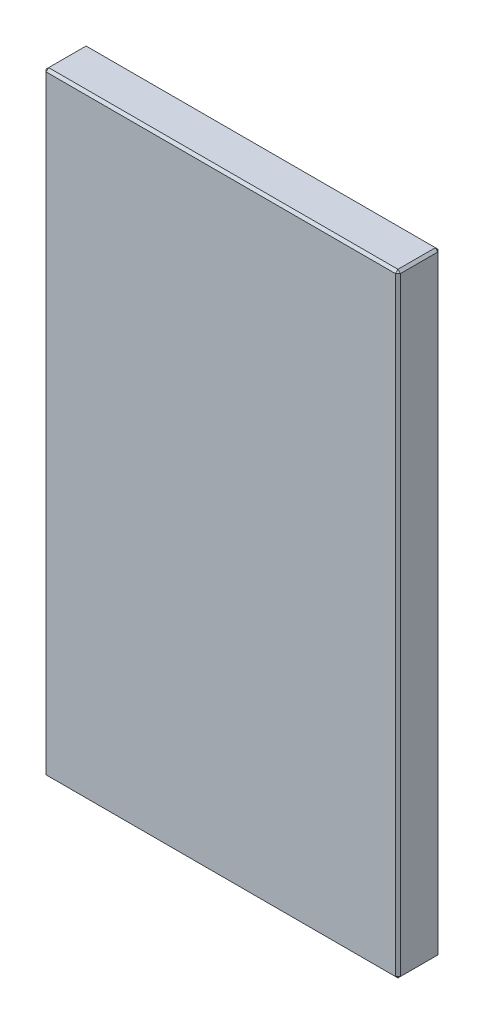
ISO-10303-21;
HEADER;
FILE_DESCRIPTION(('STEP AP214'),'2;1');
FILE_NAME('part.step','',(''),(''),'','','');
FILE_SCHEMA(('AUTOMOTIVE_DESIGN { 1 0 10303 214 1 1 1 1 }'));
ENDSEC;
DATA;
#1=APPLICATION_CONTEXT('core data for automotive mechanical design processes');
#2=APPLICATION_PROTOCOL_DEFINITION('international standard','automotive_design',2000,#1);
#3=PRODUCT_CONTEXT('',#1,'mechanical');
#4=PRODUCT('Part','Part','',(#3));
#5=PRODUCT_RELATED_PRODUCT_CATEGORY('part','',(#4));
#6=PRODUCT_DEFINITION_FORMATION('','',#4);
#7=PRODUCT_DEFINITION_CONTEXT('part definition',#1,'design');
#8=PRODUCT_DEFINITION('design','',#6,#7);
#9=PRODUCT_DEFINITION_SHAPE('','',#8);
#10=(LENGTH_UNIT() NAMED_UNIT(*) SI_UNIT(.MILLI.,.METRE.));
#11=(NAMED_UNIT(*) PLANE_ANGLE_UNIT() SI_UNIT($,.RADIAN.));
#12=(NAMED_UNIT(*) SI_UNIT($,.STERADIAN.) SOLID_ANGLE_UNIT());
#13=UNCERTAINTY_MEASURE_WITH_UNIT(LENGTH_MEASURE(1.E-05),#10,'distance_accuracy_value','');
#14=(GEOMETRIC_REPRESENTATION_CONTEXT(3) GLOBAL_UNCERTAINTY_ASSIGNED_CONTEXT((#13)) GLOBAL_UNIT_ASSIGNED_CONTEXT((#10,
#11,#12)) REPRESENTATION_CONTEXT('',''));
#15=CARTESIAN_POINT('',(0.,0.,0.));
#16=DIRECTION('',(0.,0.,1.));
#17=DIRECTION('',(1.,0.,0.));
#18=AXIS2_PLACEMENT_3D('',#15,#16,#17);
#19=CARTESIAN_POINT('',(-71.,-123.,17.));
#20=DIRECTION('',(1.,0.,0.));
#21=DIRECTION('',(0.,0.,-1.));
#22=AXIS2_PLACEMENT_3D('',#19,#20,#21);
#23=PLANE('',#22);
#24=DIRECTION('',(0.,0.,-1.));
#25=VECTOR('',#24,1.);
#26=CARTESIAN_POINT('',(-71.,122.,17.));
#27=LINE('',#26,#25);
#28=CARTESIAN_POINT('',(-71.,122.,16.));
#29=VERTEX_POINT('',#28);
#30=CARTESIAN_POINT('',(-71.,122.,1.00000000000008));
#31=VERTEX_POINT('',#30);
#32=EDGE_CURVE('E114',#29,#31,#27,.T.);
#33=ORIENTED_EDGE('',*,*,#32,.T.);
#34=DIRECTION('',(0.,-1.,0.));
#35=VECTOR('',#34,1.);
#36=CARTESIAN_POINT('',(-71.,-123.,1.00000000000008));
#37=LINE('',#36,#35);
#38=CARTESIAN_POINT('',(-71.,-122.,1.00000000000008));
#39=VERTEX_POINT('',#38);
#40=EDGE_CURVE('E110',#31,#39,#37,.T.);
#41=ORIENTED_EDGE('',*,*,#40,.T.);
#42=DIRECTION('',(0.,0.,1.));
#43=VECTOR('',#42,1.);
#44=CARTESIAN_POINT('',(-71.,-122.,17.));
#45=LINE('',#44,#43);
#46=CARTESIAN_POINT('',(-71.,-122.,16.));
#47=VERTEX_POINT('',#46);
#48=EDGE_CURVE('E103',#39,#47,#45,.T.);
#49=ORIENTED_EDGE('',*,*,#48,.T.);
#50=DIRECTION('',(0.,1.,0.));
#51=VECTOR('',#50,1.);
#52=CARTESIAN_POINT('',(-71.,123.,16.));
#53=LINE('',#52,#51);
#54=EDGE_CURVE('E107',#47,#29,#53,.T.);
#55=ORIENTED_EDGE('',*,*,#54,.T.);
#56=EDGE_LOOP('',(#33,#41,#49,#55));
#57=FACE_BOUND('',#56,.T.);
#58=ADVANCED_FACE('F15',(#57),#23,.F.);
#59=CARTESIAN_POINT('',(71.,-123.,17.));
#60=DIRECTION('',(0.,1.,0.));
#61=DIRECTION('',(0.,0.,1.));
#62=AXIS2_PLACEMENT_3D('',#59,#60,#61);
#63=PLANE('',#62);
#64=DIRECTION('',(0.,0.,-1.));
#65=VECTOR('',#64,1.);
#66=CARTESIAN_POINT('',(-70.,-123.,17.));
#67=LINE('',#66,#65);
#68=CARTESIAN_POINT('',(-70.,-123.,16.));
#69=VERTEX_POINT('',#68);
#70=CARTESIAN_POINT('',(-70.,-123.,1.00000000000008));
#71=VERTEX_POINT('',#70);
#72=EDGE_CURVE('E122',#69,#71,#67,.T.);
#73=ORIENTED_EDGE('',*,*,#72,.T.);
#74=DIRECTION('',(1.,0.,0.));
#75=VECTOR('',#74,1.);
#76=CARTESIAN_POINT('',(71.,-123.,1.00000000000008));
#77=LINE('',#76,#75);
#78=CARTESIAN_POINT('',(70.,-123.,1.00000000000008));
#79=VERTEX_POINT('',#78);
#80=EDGE_CURVE('E160',#71,#79,#77,.T.);
#81=ORIENTED_EDGE('',*,*,#80,.T.);
#82=DIRECTION('',(0.,0.,1.));
#83=VECTOR('',#82,1.);
#84=CARTESIAN_POINT('',(70.,-123.,17.));
#85=LINE('',#84,#83);
#86=CARTESIAN_POINT('',(70.,-123.,16.));
#87=VERTEX_POINT('',#86);
#88=EDGE_CURVE('E157',#79,#87,#85,.T.);
#89=ORIENTED_EDGE('',*,*,#88,.T.);
#90=DIRECTION('',(-1.,0.,0.));
#91=VECTOR('',#90,1.);
#92=CARTESIAN_POINT('',(-71.,-123.,16.));
#93=LINE('',#92,#91);
#94=EDGE_CURVE('E155',#87,#69,#93,.T.);
#95=ORIENTED_EDGE('',*,*,#94,.T.);
#96=EDGE_LOOP('',(#73,#81,#89,#95));
#97=FACE_BOUND('',#96,.T.);
#98=ADVANCED_FACE('F277',(#97),#63,.F.);
#99=CARTESIAN_POINT('',(71.,-123.,17.));
#100=DIRECTION('',(-1.,0.,0.));
#101=DIRECTION('',(0.,0.,1.));
#102=AXIS2_PLACEMENT_3D('',#99,#100,#101);
#103=PLANE('',#102);
#104=DIRECTION('',(0.,-1.,0.));
#105=VECTOR('',#104,1.);
#106=CARTESIAN_POINT('',(71.,-123.,16.));
#107=LINE('',#106,#105);
#108=CARTESIAN_POINT('',(71.,122.,16.));
#109=VERTEX_POINT('',#108);
#110=CARTESIAN_POINT('',(71.,-122.,16.));
#111=VERTEX_POINT('',#110);
#112=EDGE_CURVE('E162',#109,#111,#107,.T.);
#113=ORIENTED_EDGE('',*,*,#112,.T.);
#114=DIRECTION('',(0.,0.,-1.));
#115=VECTOR('',#114,1.);
#116=CARTESIAN_POINT('',(71.,-122.,17.));
#117=LINE('',#116,#115);
#118=CARTESIAN_POINT('',(71.,-122.,1.00000000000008));
#119=VERTEX_POINT('',#118);
#120=EDGE_CURVE('E168',#111,#119,#117,.T.);
#121=ORIENTED_EDGE('',*,*,#120,.T.);
#122=DIRECTION('',(0.,1.,0.));
#123=VECTOR('',#122,1.);
#124=CARTESIAN_POINT('',(71.,-123.,1.00000000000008));
#125=LINE('',#124,#123);
#126=CARTESIAN_POINT('',(71.,122.,1.00000000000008));
#127=VERTEX_POINT('',#126);
#128=EDGE_CURVE('E166',#119,#127,#125,.T.);
#129=ORIENTED_EDGE('',*,*,#128,.T.);
#130=DIRECTION('',(0.,0.,1.));
#131=VECTOR('',#130,1.);
#132=CARTESIAN_POINT('',(71.,122.,17.));
#133=LINE('',#132,#131);
#134=EDGE_CURVE('E164',#127,#109,#133,.T.);
#135=ORIENTED_EDGE('',*,*,#134,.T.);
#136=EDGE_LOOP('',(#113,#121,#129,#135));
#137=FACE_BOUND('',#136,.T.);
#138=ADVANCED_FACE('F254',(#137),#103,.F.);
#139=CARTESIAN_POINT('',(71.,123.,17.));
#140=DIRECTION('',(0.,-1.,0.));
#141=DIRECTION('',(1.,0.,0.));
#142=AXIS2_PLACEMENT_3D('',#139,#140,#141);
#143=PLANE('',#142);
#144=DIRECTION('',(-1.,0.,0.));
#145=VECTOR('',#144,1.);
#146=CARTESIAN_POINT('',(71.,123.,1.00000000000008));
#147=LINE('',#146,#145);
#148=CARTESIAN_POINT('',(70.,123.,1.00000000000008));
#149=VERTEX_POINT('',#148);
#150=CARTESIAN_POINT('',(-70.,123.,1.00000000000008));
#151=VERTEX_POINT('',#150);
#152=EDGE_CURVE('E150',#149,#151,#147,.T.);
#153=ORIENTED_EDGE('',*,*,#152,.T.);
#154=DIRECTION('',(0.,0.,1.));
#155=VECTOR('',#154,1.);
#156=CARTESIAN_POINT('',(-70.,123.,17.));
#157=LINE('',#156,#155);
#158=CARTESIAN_POINT('',(-70.,123.,16.));
#159=VERTEX_POINT('',#158);
#160=EDGE_CURVE('E152',#151,#159,#157,.T.);
#161=ORIENTED_EDGE('',*,*,#160,.T.);
#162=DIRECTION('',(1.,0.,0.));
#163=VECTOR('',#162,1.);
#164=CARTESIAN_POINT('',(71.,123.,16.));
#165=LINE('',#164,#163);
#166=CARTESIAN_POINT('',(70.,123.,16.));
#167=VERTEX_POINT('',#166);
#168=EDGE_CURVE('E146',#159,#167,#165,.T.);
#169=ORIENTED_EDGE('',*,*,#168,.T.);
#170=DIRECTION('',(0.,0.,-1.));
#171=VECTOR('',#170,1.);
#172=CARTESIAN_POINT('',(70.,123.,17.));
#173=LINE('',#172,#171);
#174=EDGE_CURVE('E148',#167,#149,#173,.T.);
#175=ORIENTED_EDGE('',*,*,#174,.T.);
#176=EDGE_LOOP('',(#153,#161,#169,#175));
#177=FACE_BOUND('',#176,.T.);
#178=ADVANCED_FACE('F286',(#177),#143,.F.);
#179=CARTESIAN_POINT('',(0.,0.,17.));
#180=DIRECTION('',(0.,0.,1.));
#181=DIRECTION('',(1.,0.,0.));
#182=AXIS2_PLACEMENT_3D('',#179,#180,#181);
#183=PLANE('',#182);
#184=DIRECTION('',(0.,1.,0.));
#185=VECTOR('',#184,1.);
#186=CARTESIAN_POINT('',(70.,123.,17.));
#187=LINE('',#186,#185);
#188=CARTESIAN_POINT('',(70.,-122.,17.));
#189=VERTEX_POINT('',#188);
#190=CARTESIAN_POINT('',(70.,122.,17.));
#191=VERTEX_POINT('',#190);
#192=EDGE_CURVE('E24',#189,#191,#187,.T.);
#193=ORIENTED_EDGE('',*,*,#192,.T.);
#194=DIRECTION('',(-1.,0.,0.));
#195=VECTOR('',#194,1.);
#196=CARTESIAN_POINT('',(-71.,122.,17.));
#197=LINE('',#196,#195);
#198=CARTESIAN_POINT('',(-70.,122.,17.));
#199=VERTEX_POINT('',#198);
#200=EDGE_CURVE('E9',#191,#199,#197,.T.);
#201=ORIENTED_EDGE('',*,*,#200,.T.);
#202=DIRECTION('',(0.,-1.,0.));
#203=VECTOR('',#202,1.);
#204=CARTESIAN_POINT('',(-70.,-123.,17.));
#205=LINE('',#204,#203);
#206=CARTESIAN_POINT('',(-70.,-122.,17.));
#207=VERTEX_POINT('',#206);
#208=EDGE_CURVE('E180',#199,#207,#205,.T.);
#209=ORIENTED_EDGE('',*,*,#208,.T.);
#210=DIRECTION('',(1.,0.,0.));
#211=VECTOR('',#210,1.);
#212=CARTESIAN_POINT('',(71.,-122.,17.));
#213=LINE('',#212,#211);
#214=EDGE_CURVE('E35',#207,#189,#213,.T.);
#215=ORIENTED_EDGE('',*,*,#214,.T.);
#216=EDGE_LOOP('',(#193,#201,#209,#215));
#217=FACE_BOUND('',#216,.T.);
#218=ADVANCED_FACE('F351',(#217),#183,.T.);
#219=CARTESIAN_POINT('',(0.,0.,0.));
#220=DIRECTION('',(0.,0.,1.));
#221=DIRECTION('',(1.,0.,0.));
#222=AXIS2_PLACEMENT_3D('',#219,#220,#221);
#223=PLANE('',#222);
#224=DIRECTION('',(0.,-1.,0.));
#225=VECTOR('',#224,1.);
#226=CARTESIAN_POINT('',(70.,0.,0.));
#227=LINE('',#226,#225);
#228=CARTESIAN_POINT('',(70.,122.,0.));
#229=VERTEX_POINT('',#228);
#230=CARTESIAN_POINT('',(70.,-122.,0.));
#231=VERTEX_POINT('',#230);
#232=EDGE_CURVE('E175',#229,#231,#227,.T.);
#233=ORIENTED_EDGE('',*,*,#232,.T.);
#234=DIRECTION('',(-1.,0.,0.));
#235=VECTOR('',#234,1.);
#236=CARTESIAN_POINT('',(0.,-122.,0.));
#237=LINE('',#236,#235);
#238=CARTESIAN_POINT('',(-70.,-122.,0.));
#239=VERTEX_POINT('',#238);
#240=EDGE_CURVE('E177',#231,#239,#237,.T.);
#241=ORIENTED_EDGE('',*,*,#240,.T.);
#242=DIRECTION('',(0.,1.,0.));
#243=VECTOR('',#242,1.);
#244=CARTESIAN_POINT('',(-70.,0.,0.));
#245=LINE('',#244,#243);
#246=CARTESIAN_POINT('',(-70.,122.,0.));
#247=VERTEX_POINT('',#246);
#248=EDGE_CURVE('E173',#239,#247,#245,.T.);
#249=ORIENTED_EDGE('',*,*,#248,.T.);
#250=DIRECTION('',(1.,0.,0.));
#251=VECTOR('',#250,1.);
#252=CARTESIAN_POINT('',(0.,122.,0.));
#253=LINE('',#252,#251);
#254=EDGE_CURVE('E171',#247,#229,#253,.T.);
#255=ORIENTED_EDGE('',*,*,#254,.T.);
#256=EDGE_LOOP('',(#233,#241,#249,#255));
#257=FACE_BOUND('',#256,.T.);
#258=ADVANCED_FACE('F246',(#257),#223,.F.);
#259=CARTESIAN_POINT('',(71.,-122.,17.));
#260=DIRECTION('',(-0.707106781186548,0.707106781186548,0.));
#261=DIRECTION('',(0.,0.,-1.));
#262=AXIS2_PLACEMENT_3D('',#259,#260,#261);
#263=PLANE('',#262);
#264=DIRECTION('',(-0.707106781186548,-0.707106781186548,0.));
#265=VECTOR('',#264,1.);
#266=CARTESIAN_POINT('',(70.,-123.,16.));
#267=LINE('',#266,#265);
#268=EDGE_CURVE('E19',#87,#111,#267,.F.);
#269=ORIENTED_EDGE('',*,*,#268,.F.);
#270=ORIENTED_EDGE('',*,*,#88,.F.);
#271=DIRECTION('',(0.707106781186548,0.707106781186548,0.));
#272=VECTOR('',#271,1.);
#273=CARTESIAN_POINT('',(71.,-122.,1.00000000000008));
#274=LINE('',#273,#272);
#275=EDGE_CURVE('E142',#119,#79,#274,.F.);
#276=ORIENTED_EDGE('',*,*,#275,.F.);
#277=ORIENTED_EDGE('',*,*,#120,.F.);
#278=EDGE_LOOP('',(#269,#270,#276,#277));
#279=FACE_BOUND('',#278,.T.);
#280=ADVANCED_FACE('F17',(#279),#263,.F.);
#281=CARTESIAN_POINT('',(70.,-123.,16.));
#282=DIRECTION('',(0.577350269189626,-0.577350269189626,0.577350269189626));
#283=DIRECTION('',(0.707106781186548,0.,-0.707106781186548));
#284=AXIS2_PLACEMENT_3D('',#281,#282,#283);
#285=PLANE('',#284);
#286=DIRECTION('',(0.,-0.707106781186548,-0.707106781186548));
#287=VECTOR('',#286,1.);
#288=CARTESIAN_POINT('',(70.,-123.,16.));
#289=LINE('',#288,#287);
#290=EDGE_CURVE('E227',#87,#189,#289,.F.);
#291=ORIENTED_EDGE('',*,*,#290,.F.);
#292=ORIENTED_EDGE('',*,*,#268,.T.);
#293=DIRECTION('',(-0.707106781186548,0.,0.707106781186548));
#294=VECTOR('',#293,1.);
#295=CARTESIAN_POINT('',(70.5,-122.,16.5));
#296=LINE('',#295,#294);
#297=EDGE_CURVE('E229',#189,#111,#296,.F.);
#298=ORIENTED_EDGE('',*,*,#297,.F.);
#299=EDGE_LOOP('',(#291,#292,#298));
#300=FACE_BOUND('',#299,.T.);
#301=ADVANCED_FACE('F272',(#300),#285,.T.);
#302=CARTESIAN_POINT('',(71.,-122.,1.00000000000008));
#303=DIRECTION('',(0.577350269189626,-0.577350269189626,-0.577350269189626));
#304=DIRECTION('',(-0.707106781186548,0.,-0.707106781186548));
#305=AXIS2_PLACEMENT_3D('',#302,#303,#304);
#306=PLANE('',#305);
#307=DIRECTION('',(-0.707106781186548,0.,-0.707106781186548));
#308=VECTOR('',#307,1.);
#309=CARTESIAN_POINT('',(71.,-122.,1.00000000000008));
#310=LINE('',#309,#308);
#311=EDGE_CURVE('E221',#119,#231,#310,.T.);
#312=ORIENTED_EDGE('',*,*,#311,.F.);
#313=ORIENTED_EDGE('',*,*,#275,.T.);
#314=DIRECTION('',(0.,-0.707106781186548,0.707106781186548));
#315=VECTOR('',#314,1.);
#316=CARTESIAN_POINT('',(70.,-122.5,0.500000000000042));
#317=LINE('',#316,#315);
#318=EDGE_CURVE('E224',#231,#79,#317,.T.);
#319=ORIENTED_EDGE('',*,*,#318,.F.);
#320=EDGE_LOOP('',(#312,#313,#319));
#321=FACE_BOUND('',#320,.T.);
#322=ADVANCED_FACE('F236',(#321),#306,.T.);
#323=CARTESIAN_POINT('',(70.,0.,17.));
#324=DIRECTION('',(0.707106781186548,0.,0.707106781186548));
#325=DIRECTION('',(0.,-1.,0.));
#326=AXIS2_PLACEMENT_3D('',#323,#324,#325);
#327=PLANE('',#326);
#328=ORIENTED_EDGE('',*,*,#297,.T.);
#329=ORIENTED_EDGE('',*,*,#112,.F.);
#330=DIRECTION('',(0.707106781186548,0.,-0.707106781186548));
#331=VECTOR('',#330,1.);
#332=CARTESIAN_POINT('',(71.,122.,16.));
#333=LINE('',#332,#331);
#334=EDGE_CURVE('E215',#191,#109,#333,.T.);
#335=ORIENTED_EDGE('',*,*,#334,.F.);
#336=ORIENTED_EDGE('',*,*,#192,.F.);
#337=EDGE_LOOP('',(#328,#329,#335,#336));
#338=FACE_BOUND('',#337,.T.);
#339=ADVANCED_FACE('F267',(#338),#327,.T.);
#340=CARTESIAN_POINT('',(0.,-122.,17.));
#341=DIRECTION('',(0.,-0.707106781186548,0.707106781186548));
#342=DIRECTION('',(-1.,0.,0.));
#343=AXIS2_PLACEMENT_3D('',#340,#341,#342);
#344=PLANE('',#343);
#345=ORIENTED_EDGE('',*,*,#290,.T.);
#346=ORIENTED_EDGE('',*,*,#214,.F.);
#347=DIRECTION('',(0.,0.707106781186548,0.707106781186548));
#348=VECTOR('',#347,1.);
#349=CARTESIAN_POINT('',(-70.,-122.5,16.5));
#350=LINE('',#349,#348);
#351=EDGE_CURVE('E126',#69,#207,#350,.T.);
#352=ORIENTED_EDGE('',*,*,#351,.F.);
#353=ORIENTED_EDGE('',*,*,#94,.F.);
#354=EDGE_LOOP('',(#345,#346,#352,#353));
#355=FACE_BOUND('',#354,.T.);
#356=ADVANCED_FACE('F275',(#355),#344,.T.);
#357=CARTESIAN_POINT('',(-70.,-123.,17.));
#358=DIRECTION('',(0.707106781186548,0.707106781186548,0.));
#359=DIRECTION('',(0.,0.,-1.));
#360=AXIS2_PLACEMENT_3D('',#357,#358,#359);
#361=PLANE('',#360);
#362=DIRECTION('',(0.707106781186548,-0.707106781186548,0.));
#363=VECTOR('',#362,1.);
#364=CARTESIAN_POINT('',(-70.,-123.,1.00000000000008));
#365=LINE('',#364,#363);
#366=EDGE_CURVE('E127',#71,#39,#365,.F.);
#367=ORIENTED_EDGE('',*,*,#366,.F.);
#368=ORIENTED_EDGE('',*,*,#72,.F.);
#369=DIRECTION('',(-0.707106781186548,0.707106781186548,0.));
#370=VECTOR('',#369,1.);
#371=CARTESIAN_POINT('',(-71.,-122.,16.));
#372=LINE('',#371,#370);
#373=EDGE_CURVE('E118',#47,#69,#372,.F.);
#374=ORIENTED_EDGE('',*,*,#373,.F.);
#375=ORIENTED_EDGE('',*,*,#48,.F.);
#376=EDGE_LOOP('',(#367,#368,#374,#375));
#377=FACE_BOUND('',#376,.T.);
#378=ADVANCED_FACE('F120',(#377),#361,.F.);
#379=CARTESIAN_POINT('',(71.,-123.,1.00000000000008));
#380=DIRECTION('',(0.,0.707106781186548,0.707106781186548));
#381=DIRECTION('',(1.,0.,0.));
#382=AXIS2_PLACEMENT_3D('',#379,#380,#381);
#383=PLANE('',#382);
#384=ORIENTED_EDGE('',*,*,#318,.T.);
#385=ORIENTED_EDGE('',*,*,#80,.F.);
#386=DIRECTION('',(0.,0.707106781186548,-0.707106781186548));
#387=VECTOR('',#386,1.);
#388=CARTESIAN_POINT('',(-70.,-123.,1.00000000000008));
#389=LINE('',#388,#387);
#390=EDGE_CURVE('E211',#239,#71,#389,.F.);
#391=ORIENTED_EDGE('',*,*,#390,.F.);
#392=ORIENTED_EDGE('',*,*,#240,.F.);
#393=EDGE_LOOP('',(#384,#385,#391,#392));
#394=FACE_BOUND('',#393,.T.);
#395=ADVANCED_FACE('F243',(#394),#383,.F.);
#396=CARTESIAN_POINT('',(71.,-123.,1.00000000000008));
#397=DIRECTION('',(-0.707106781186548,0.,0.707106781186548));
#398=DIRECTION('',(0.,1.,0.));
#399=AXIS2_PLACEMENT_3D('',#396,#397,#398);
#400=PLANE('',#399);
#401=ORIENTED_EDGE('',*,*,#311,.T.);
#402=ORIENTED_EDGE('',*,*,#232,.F.);
#403=DIRECTION('',(0.707106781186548,0.,0.707106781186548));
#404=VECTOR('',#403,1.);
#405=CARTESIAN_POINT('',(71.,122.,1.00000000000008));
#406=LINE('',#405,#404);
#407=EDGE_CURVE('E208',#127,#229,#406,.F.);
#408=ORIENTED_EDGE('',*,*,#407,.F.);
#409=ORIENTED_EDGE('',*,*,#128,.F.);
#410=EDGE_LOOP('',(#401,#402,#408,#409));
#411=FACE_BOUND('',#410,.T.);
#412=ADVANCED_FACE('F251',(#411),#400,.F.);
#413=CARTESIAN_POINT('',(70.,123.,17.));
#414=DIRECTION('',(-0.707106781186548,-0.707106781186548,0.));
#415=DIRECTION('',(0.,0.,-1.));
#416=AXIS2_PLACEMENT_3D('',#413,#414,#415);
#417=PLANE('',#416);
#418=DIRECTION('',(0.707106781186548,-0.707106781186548,0.));
#419=VECTOR('',#418,1.);
#420=CARTESIAN_POINT('',(71.,122.,16.));
#421=LINE('',#420,#419);
#422=EDGE_CURVE('E218',#109,#167,#421,.F.);
#423=ORIENTED_EDGE('',*,*,#422,.F.);
#424=ORIENTED_EDGE('',*,*,#134,.F.);
#425=DIRECTION('',(-0.707106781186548,0.707106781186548,0.));
#426=VECTOR('',#425,1.);
#427=CARTESIAN_POINT('',(71.,122.,1.00000000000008));
#428=LINE('',#427,#426);
#429=EDGE_CURVE('E205',#149,#127,#428,.F.);
#430=ORIENTED_EDGE('',*,*,#429,.F.);
#431=ORIENTED_EDGE('',*,*,#174,.F.);
#432=EDGE_LOOP('',(#423,#424,#430,#431));
#433=FACE_BOUND('',#432,.T.);
#434=ADVANCED_FACE('F259',(#433),#417,.F.);
#435=CARTESIAN_POINT('',(71.,122.,16.));
#436=DIRECTION('',(0.577350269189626,0.577350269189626,0.577350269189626));
#437=DIRECTION('',(0.707106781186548,0.,-0.707106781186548));
#438=AXIS2_PLACEMENT_3D('',#435,#436,#437);
#439=PLANE('',#438);
#440=ORIENTED_EDGE('',*,*,#334,.T.);
#441=ORIENTED_EDGE('',*,*,#422,.T.);
#442=DIRECTION('',(0.,-0.707106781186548,0.707106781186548));
#443=VECTOR('',#442,1.);
#444=CARTESIAN_POINT('',(70.,122.5,16.5));
#445=LINE('',#444,#443);
#446=EDGE_CURVE('E134',#191,#167,#445,.F.);
#447=ORIENTED_EDGE('',*,*,#446,.F.);
#448=EDGE_LOOP('',(#440,#441,#447));
#449=FACE_BOUND('',#448,.T.);
#450=ADVANCED_FACE('F264',(#449),#439,.T.);
#451=CARTESIAN_POINT('',(-71.,-122.,16.));
#452=DIRECTION('',(-0.577350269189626,-0.577350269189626,0.577350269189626));
#453=DIRECTION('',(0.707106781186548,0.,0.707106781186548));
#454=AXIS2_PLACEMENT_3D('',#451,#452,#453);
#455=PLANE('',#454);
#456=ORIENTED_EDGE('',*,*,#373,.T.);
#457=ORIENTED_EDGE('',*,*,#351,.T.);
#458=DIRECTION('',(-0.707106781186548,0.,-0.707106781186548));
#459=VECTOR('',#458,1.);
#460=CARTESIAN_POINT('',(-71.,-122.,16.));
#461=LINE('',#460,#459);
#462=EDGE_CURVE('E130',#47,#207,#461,.F.);
#463=ORIENTED_EDGE('',*,*,#462,.F.);
#464=EDGE_LOOP('',(#456,#457,#463));
#465=FACE_BOUND('',#464,.T.);
#466=ADVANCED_FACE('F131',(#465),#455,.T.);
#467=CARTESIAN_POINT('',(-70.,-123.,1.00000000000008));
#468=DIRECTION('',(-0.577350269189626,-0.577350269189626,-0.577350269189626));
#469=DIRECTION('',(-0.707106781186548,0.,0.707106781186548));
#470=AXIS2_PLACEMENT_3D('',#467,#468,#469);
#471=PLANE('',#470);
#472=ORIENTED_EDGE('',*,*,#390,.T.);
#473=ORIENTED_EDGE('',*,*,#366,.T.);
#474=DIRECTION('',(-0.707106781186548,0.,0.707106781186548));
#475=VECTOR('',#474,1.);
#476=CARTESIAN_POINT('',(-70.5,-122.,0.500000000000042));
#477=LINE('',#476,#475);
#478=EDGE_CURVE('E135',#239,#39,#477,.T.);
#479=ORIENTED_EDGE('',*,*,#478,.F.);
#480=EDGE_LOOP('',(#472,#473,#479));
#481=FACE_BOUND('',#480,.T.);
#482=ADVANCED_FACE('F320',(#481),#471,.T.);
#483=CARTESIAN_POINT('',(71.,122.,1.00000000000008));
#484=DIRECTION('',(0.577350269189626,0.577350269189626,-0.577350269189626));
#485=DIRECTION('',(-0.707106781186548,0.,-0.707106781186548));
#486=AXIS2_PLACEMENT_3D('',#483,#484,#485);
#487=PLANE('',#486);
#488=ORIENTED_EDGE('',*,*,#429,.T.);
#489=ORIENTED_EDGE('',*,*,#407,.T.);
#490=DIRECTION('',(0.,-0.707106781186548,-0.707106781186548));
#491=VECTOR('',#490,1.);
#492=CARTESIAN_POINT('',(70.,122.5,0.500000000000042));
#493=LINE('',#492,#491);
#494=EDGE_CURVE('E198',#149,#229,#493,.T.);
#495=ORIENTED_EDGE('',*,*,#494,.F.);
#496=EDGE_LOOP('',(#488,#489,#495));
#497=FACE_BOUND('',#496,.T.);
#498=ADVANCED_FACE('F316',(#497),#487,.T.);
#499=CARTESIAN_POINT('',(0.,122.,17.));
#500=DIRECTION('',(0.,0.707106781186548,0.707106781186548));
#501=DIRECTION('',(1.,0.,0.));
#502=AXIS2_PLACEMENT_3D('',#499,#500,#501);
#503=PLANE('',#502);
#504=ORIENTED_EDGE('',*,*,#446,.T.);
#505=ORIENTED_EDGE('',*,*,#168,.F.);
#506=DIRECTION('',(0.,0.707106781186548,-0.707106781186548));
#507=VECTOR('',#506,1.);
#508=CARTESIAN_POINT('',(-70.,123.,16.));
#509=LINE('',#508,#507);
#510=EDGE_CURVE('E195',#199,#159,#509,.T.);
#511=ORIENTED_EDGE('',*,*,#510,.F.);
#512=ORIENTED_EDGE('',*,*,#200,.F.);
#513=EDGE_LOOP('',(#504,#505,#511,#512));
#514=FACE_BOUND('',#513,.T.);
#515=ADVANCED_FACE('F313',(#514),#503,.T.);
#516=CARTESIAN_POINT('',(-70.,0.,17.));
#517=DIRECTION('',(-0.707106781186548,0.,0.707106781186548));
#518=DIRECTION('',(0.,1.,0.));
#519=AXIS2_PLACEMENT_3D('',#516,#517,#518);
#520=PLANE('',#519);
#521=ORIENTED_EDGE('',*,*,#462,.T.);
#522=ORIENTED_EDGE('',*,*,#208,.F.);
#523=DIRECTION('',(0.707106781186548,0.,0.707106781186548));
#524=VECTOR('',#523,1.);
#525=CARTESIAN_POINT('',(-70.5,122.,16.5));
#526=LINE('',#525,#524);
#527=EDGE_CURVE('E138',#29,#199,#526,.T.);
#528=ORIENTED_EDGE('',*,*,#527,.F.);
#529=ORIENTED_EDGE('',*,*,#54,.F.);
#530=EDGE_LOOP('',(#521,#522,#528,#529));
#531=FACE_BOUND('',#530,.T.);
#532=ADVANCED_FACE('F137',(#531),#520,.T.);
#533=CARTESIAN_POINT('',(-71.,-123.,1.00000000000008));
#534=DIRECTION('',(0.707106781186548,0.,0.707106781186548));
#535=DIRECTION('',(0.,-1.,0.));
#536=AXIS2_PLACEMENT_3D('',#533,#534,#535);
#537=PLANE('',#536);
#538=ORIENTED_EDGE('',*,*,#478,.T.);
#539=ORIENTED_EDGE('',*,*,#40,.F.);
#540=DIRECTION('',(0.707106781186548,0.,-0.707106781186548));
#541=VECTOR('',#540,1.);
#542=CARTESIAN_POINT('',(-71.,122.,1.00000000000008));
#543=LINE('',#542,#541);
#544=EDGE_CURVE('E191',#247,#31,#543,.F.);
#545=ORIENTED_EDGE('',*,*,#544,.F.);
#546=ORIENTED_EDGE('',*,*,#248,.F.);
#547=EDGE_LOOP('',(#538,#539,#545,#546));
#548=FACE_BOUND('',#547,.T.);
#549=ADVANCED_FACE('F306',(#548),#537,.F.);
#550=CARTESIAN_POINT('',(71.,123.,1.00000000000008));
#551=DIRECTION('',(0.,-0.707106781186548,0.707106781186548));
#552=DIRECTION('',(-1.,0.,0.));
#553=AXIS2_PLACEMENT_3D('',#550,#551,#552);
#554=PLANE('',#553);
#555=ORIENTED_EDGE('',*,*,#494,.T.);
#556=ORIENTED_EDGE('',*,*,#254,.F.);
#557=DIRECTION('',(0.,0.707106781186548,0.707106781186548));
#558=VECTOR('',#557,1.);
#559=CARTESIAN_POINT('',(-70.,122.5,0.500000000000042));
#560=LINE('',#559,#558);
#561=EDGE_CURVE('E188',#151,#247,#560,.F.);
#562=ORIENTED_EDGE('',*,*,#561,.F.);
#563=ORIENTED_EDGE('',*,*,#152,.F.);
#564=EDGE_LOOP('',(#555,#556,#562,#563));
#565=FACE_BOUND('',#564,.T.);
#566=ADVANCED_FACE('F302',(#565),#554,.F.);
#567=CARTESIAN_POINT('',(-70.,123.,16.));
#568=DIRECTION('',(-0.577350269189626,0.577350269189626,0.577350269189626));
#569=DIRECTION('',(0.707106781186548,0.,0.707106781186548));
#570=AXIS2_PLACEMENT_3D('',#567,#568,#569);
#571=PLANE('',#570);
#572=ORIENTED_EDGE('',*,*,#527,.T.);
#573=ORIENTED_EDGE('',*,*,#510,.T.);
#574=DIRECTION('',(0.707106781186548,0.707106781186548,0.));
#575=VECTOR('',#574,1.);
#576=CARTESIAN_POINT('',(-70.,123.,16.));
#577=LINE('',#576,#575);
#578=EDGE_CURVE('E186',#29,#159,#577,.T.);
#579=ORIENTED_EDGE('',*,*,#578,.F.);
#580=EDGE_LOOP('',(#572,#573,#579));
#581=FACE_BOUND('',#580,.T.);
#582=ADVANCED_FACE('F298',(#581),#571,.T.);
#583=CARTESIAN_POINT('',(-71.,122.,1.00000000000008));
#584=DIRECTION('',(-0.577350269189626,0.577350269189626,-0.577350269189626));
#585=DIRECTION('',(-0.707106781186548,0.,0.707106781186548));
#586=AXIS2_PLACEMENT_3D('',#583,#584,#585);
#587=PLANE('',#586);
#588=ORIENTED_EDGE('',*,*,#561,.T.);
#589=ORIENTED_EDGE('',*,*,#544,.T.);
#590=DIRECTION('',(-0.707106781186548,-0.707106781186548,0.));
#591=VECTOR('',#590,1.);
#592=CARTESIAN_POINT('',(-71.,122.,1.00000000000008));
#593=LINE('',#592,#591);
#594=EDGE_CURVE('E184',#151,#31,#593,.T.);
#595=ORIENTED_EDGE('',*,*,#594,.F.);
#596=EDGE_LOOP('',(#588,#589,#595));
#597=FACE_BOUND('',#596,.T.);
#598=ADVANCED_FACE('F294',(#597),#587,.T.);
#599=CARTESIAN_POINT('',(-71.,122.,17.));
#600=DIRECTION('',(0.707106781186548,-0.707106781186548,0.));
#601=DIRECTION('',(0.,0.,-1.));
#602=AXIS2_PLACEMENT_3D('',#599,#600,#601);
#603=PLANE('',#602);
#604=ORIENTED_EDGE('',*,*,#578,.T.);
#605=ORIENTED_EDGE('',*,*,#160,.F.);
#606=ORIENTED_EDGE('',*,*,#594,.T.);
#607=ORIENTED_EDGE('',*,*,#32,.F.);
#608=EDGE_LOOP('',(#604,#605,#606,#607));
#609=FACE_BOUND('',#608,.T.);
#610=ADVANCED_FACE('F291',(#609),#603,.F.);
#611=CLOSED_SHELL('',(#58,#98,#138,#178,#218,#258,#280,#301,#322,#339,#356,#378,#395,#412,#434,
#450,#466,#482,#498,#515,#532,#549,#566,#582,#598,#610));
#612=MANIFOLD_SOLID_BREP('B1',#611);
#613=ADVANCED_BREP_SHAPE_REPRESENTATION('',(#18,#612),#14);
#614=SHAPE_DEFINITION_REPRESENTATION(#9,#613);
ENDSEC;
END-ISO-10303-21;
